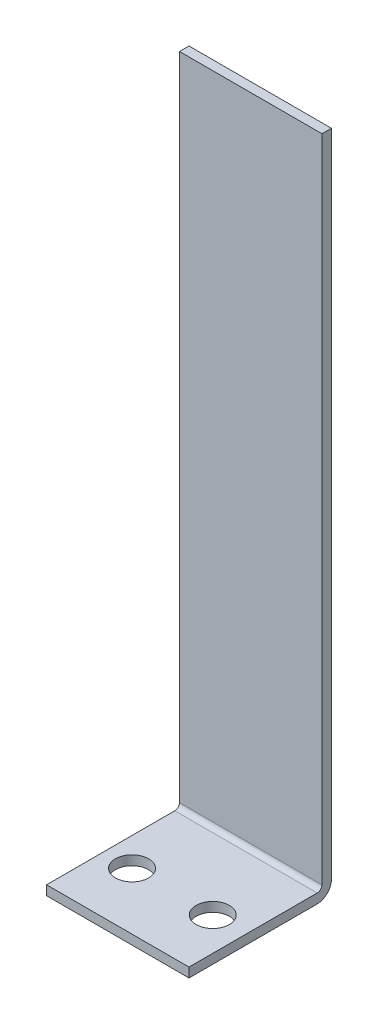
ISO-10303-21;
HEADER;
FILE_DESCRIPTION(('STEP AP214'),'2;1');
FILE_NAME('part.step','',(''),(''),'','','');
FILE_SCHEMA(('AUTOMOTIVE_DESIGN { 1 0 10303 214 1 1 1 1 }'));
ENDSEC;
DATA;
#1=APPLICATION_CONTEXT('core data for automotive mechanical design processes');
#2=APPLICATION_PROTOCOL_DEFINITION('international standard','automotive_design',2000,#1);
#3=PRODUCT_CONTEXT('',#1,'mechanical');
#4=PRODUCT('Part','Part','',(#3));
#5=PRODUCT_RELATED_PRODUCT_CATEGORY('part','',(#4));
#6=PRODUCT_DEFINITION_FORMATION('','',#4);
#7=PRODUCT_DEFINITION_CONTEXT('part definition',#1,'design');
#8=PRODUCT_DEFINITION('design','',#6,#7);
#9=PRODUCT_DEFINITION_SHAPE('','',#8);
#10=(LENGTH_UNIT() NAMED_UNIT(*) SI_UNIT(.MILLI.,.METRE.));
#11=(NAMED_UNIT(*) PLANE_ANGLE_UNIT() SI_UNIT($,.RADIAN.));
#12=(NAMED_UNIT(*) SI_UNIT($,.STERADIAN.) SOLID_ANGLE_UNIT());
#13=UNCERTAINTY_MEASURE_WITH_UNIT(LENGTH_MEASURE(1.E-05),#10,'distance_accuracy_value','');
#14=(GEOMETRIC_REPRESENTATION_CONTEXT(3) GLOBAL_UNCERTAINTY_ASSIGNED_CONTEXT((#13)) GLOBAL_UNIT_ASSIGNED_CONTEXT((#10,
#11,#12)) REPRESENTATION_CONTEXT('',''));
#15=CARTESIAN_POINT('',(0.,0.,0.));
#16=DIRECTION('',(0.,0.,1.));
#17=DIRECTION('',(1.,0.,0.));
#18=AXIS2_PLACEMENT_3D('',#15,#16,#17);
#19=CARTESIAN_POINT('',(0.,0.,30.));
#20=DIRECTION('',(0.,-1.,0.));
#21=DIRECTION('',(0.,0.,-1.));
#22=AXIS2_PLACEMENT_3D('',#19,#20,#21);
#23=PLANE('',#22);
#24=DIRECTION('',(0.,0.,1.));
#25=VECTOR('',#24,1.);
#26=CARTESIAN_POINT('',(0.,0.,30.));
#27=LINE('',#26,#25);
#28=CARTESIAN_POINT('',(0.,0.,3.));
#29=VERTEX_POINT('',#28);
#30=CARTESIAN_POINT('',(0.,0.,30.));
#31=VERTEX_POINT('',#30);
#32=EDGE_CURVE('E71',#29,#31,#27,.T.);
#33=ORIENTED_EDGE('',*,*,#32,.F.);
#34=DIRECTION('',(-1.,0.,0.));
#35=VECTOR('',#34,1.);
#36=CARTESIAN_POINT('',(0.,0.,2.99999999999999));
#37=LINE('',#36,#35);
#38=CARTESIAN_POINT('',(30.,0.,2.99999999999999));
#39=VERTEX_POINT('',#38);
#40=EDGE_CURVE('E223',#39,#29,#37,.T.);
#41=ORIENTED_EDGE('',*,*,#40,.F.);
#42=DIRECTION('',(0.,0.,1.));
#43=VECTOR('',#42,1.);
#44=CARTESIAN_POINT('',(30.,0.,30.));
#45=LINE('',#44,#43);
#46=CARTESIAN_POINT('',(30.,0.,30.));
#47=VERTEX_POINT('',#46);
#48=EDGE_CURVE('E63',#39,#47,#45,.T.);
#49=ORIENTED_EDGE('',*,*,#48,.T.);
#50=DIRECTION('',(1.,0.,0.));
#51=VECTOR('',#50,1.);
#52=CARTESIAN_POINT('',(0.,0.,30.));
#53=LINE('',#52,#51);
#54=EDGE_CURVE('E171',#47,#31,#53,.F.);
#55=ORIENTED_EDGE('',*,*,#54,.T.);
#56=EDGE_LOOP('',(#33,#41,#49,#55));
#57=FACE_BOUND('',#56,.T.);
#58=CARTESIAN_POINT('',(6.,0.,18.));
#59=DIRECTION('',(0.,1.,0.));
#60=DIRECTION('',(0.,0.,1.));
#61=AXIS2_PLACEMENT_3D('',#58,#59,#60);
#62=CIRCLE('',#61,3.5);
#63=CARTESIAN_POINT('',(6.,0.,21.5));
#64=VERTEX_POINT('',#63);
#65=EDGE_CURVE('E169',#64,#64,#62,.T.);
#66=ORIENTED_EDGE('',*,*,#65,.T.);
#67=EDGE_LOOP('',(#66));
#68=FACE_BOUND('',#67,.T.);
#69=CARTESIAN_POINT('',(23.,0.,18.));
#70=DIRECTION('',(0.,1.,0.));
#71=DIRECTION('',(0.,0.,1.));
#72=AXIS2_PLACEMENT_3D('',#69,#70,#71);
#73=CIRCLE('',#72,3.5);
#74=CARTESIAN_POINT('',(23.,0.,21.5));
#75=VERTEX_POINT('',#74);
#76=EDGE_CURVE('E20',#75,#75,#73,.T.);
#77=ORIENTED_EDGE('',*,*,#76,.T.);
#78=EDGE_LOOP('',(#77));
#79=FACE_BOUND('',#78,.T.);
#80=ADVANCED_FACE('F17',(#57,#68,#79),#23,.T.);
#81=CARTESIAN_POINT('',(23.,2.,18.));
#82=DIRECTION('',(0.,1.,0.));
#83=DIRECTION('',(0.,0.,1.));
#84=AXIS2_PLACEMENT_3D('',#81,#82,#83);
#85=CYLINDRICAL_SURFACE('',#84,3.5);
#86=ORIENTED_EDGE('',*,*,#76,.F.);
#87=EDGE_LOOP('',(#86));
#88=FACE_BOUND('',#87,.T.);
#89=CARTESIAN_POINT('',(23.,2.,18.));
#90=DIRECTION('',(0.,1.,0.));
#91=DIRECTION('',(0.,0.,1.));
#92=AXIS2_PLACEMENT_3D('',#89,#90,#91);
#93=CIRCLE('',#92,3.5);
#94=CARTESIAN_POINT('',(23.,2.,21.5));
#95=VERTEX_POINT('',#94);
#96=EDGE_CURVE('E156',#95,#95,#93,.T.);
#97=ORIENTED_EDGE('',*,*,#96,.T.);
#98=EDGE_LOOP('',(#97));
#99=FACE_BOUND('',#98,.T.);
#100=ADVANCED_FACE('F143',(#88,#99),#85,.F.);
#101=CARTESIAN_POINT('',(6.,2.,18.));
#102=DIRECTION('',(0.,1.,0.));
#103=DIRECTION('',(0.,0.,1.));
#104=AXIS2_PLACEMENT_3D('',#101,#102,#103);
#105=CYLINDRICAL_SURFACE('',#104,3.5);
#106=ORIENTED_EDGE('',*,*,#65,.F.);
#107=EDGE_LOOP('',(#106));
#108=FACE_BOUND('',#107,.T.);
#109=CARTESIAN_POINT('',(6.,2.,18.));
#110=DIRECTION('',(0.,1.,0.));
#111=DIRECTION('',(0.,0.,1.));
#112=AXIS2_PLACEMENT_3D('',#109,#110,#111);
#113=CIRCLE('',#112,3.5);
#114=CARTESIAN_POINT('',(6.,2.,21.5));
#115=VERTEX_POINT('',#114);
#116=EDGE_CURVE('E158',#115,#115,#113,.T.);
#117=ORIENTED_EDGE('',*,*,#116,.T.);
#118=EDGE_LOOP('',(#117));
#119=FACE_BOUND('',#118,.T.);
#120=ADVANCED_FACE('F140',(#108,#119),#105,.F.);
#121=CARTESIAN_POINT('',(0.,2.,30.));
#122=DIRECTION('',(0.,0.,-1.));
#123=DIRECTION('',(0.,1.,0.));
#124=AXIS2_PLACEMENT_3D('',#121,#122,#123);
#125=PLANE('',#124);
#126=ORIENTED_EDGE('',*,*,#54,.F.);
#127=DIRECTION('',(0.,1.,0.));
#128=VECTOR('',#127,1.);
#129=CARTESIAN_POINT('',(30.,2.,30.));
#130=LINE('',#129,#128);
#131=CARTESIAN_POINT('',(30.,2.,30.));
#132=VERTEX_POINT('',#131);
#133=EDGE_CURVE('E177',#47,#132,#130,.T.);
#134=ORIENTED_EDGE('',*,*,#133,.T.);
#135=DIRECTION('',(1.,0.,0.));
#136=VECTOR('',#135,1.);
#137=CARTESIAN_POINT('',(0.,2.,30.));
#138=LINE('',#137,#136);
#139=CARTESIAN_POINT('',(0.,2.,30.));
#140=VERTEX_POINT('',#139);
#141=EDGE_CURVE('E162',#132,#140,#138,.F.);
#142=ORIENTED_EDGE('',*,*,#141,.T.);
#143=DIRECTION('',(0.,1.,0.));
#144=VECTOR('',#143,1.);
#145=CARTESIAN_POINT('',(0.,2.,30.));
#146=LINE('',#145,#144);
#147=EDGE_CURVE('E168',#31,#140,#146,.T.);
#148=ORIENTED_EDGE('',*,*,#147,.F.);
#149=EDGE_LOOP('',(#126,#134,#142,#148));
#150=FACE_BOUND('',#149,.T.);
#151=ADVANCED_FACE('F136',(#150),#125,.F.);
#152=CARTESIAN_POINT('',(0.,3.,2.99999999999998));
#153=DIRECTION('',(-1.,0.,0.));
#154=DIRECTION('',(0.,0.,1.));
#155=AXIS2_PLACEMENT_3D('',#152,#153,#154);
#156=CYLINDRICAL_SURFACE('',#155,3.);
#157=CARTESIAN_POINT('',(30.,3.,2.99999999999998));
#158=DIRECTION('',(-1.,0.,0.));
#159=DIRECTION('',(0.,0.,1.));
#160=AXIS2_PLACEMENT_3D('',#157,#158,#159);
#161=CIRCLE('',#160,3.);
#162=CARTESIAN_POINT('',(30.,3.,0.));
#163=VERTEX_POINT('',#162);
#164=EDGE_CURVE('E164',#39,#163,#161,.F.);
#165=ORIENTED_EDGE('',*,*,#164,.F.);
#166=ORIENTED_EDGE('',*,*,#40,.T.);
#167=CARTESIAN_POINT('',(0.,3.,2.99999999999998));
#168=DIRECTION('',(-1.,0.,0.));
#169=DIRECTION('',(0.,0.,1.));
#170=AXIS2_PLACEMENT_3D('',#167,#168,#169);
#171=CIRCLE('',#170,3.);
#172=CARTESIAN_POINT('',(0.,3.,0.));
#173=VERTEX_POINT('',#172);
#174=EDGE_CURVE('E185',#173,#29,#171,.T.);
#175=ORIENTED_EDGE('',*,*,#174,.F.);
#176=DIRECTION('',(1.,0.,0.));
#177=VECTOR('',#176,1.);
#178=CARTESIAN_POINT('',(0.,3.,0.));
#179=LINE('',#178,#177);
#180=EDGE_CURVE('E186',#163,#173,#179,.F.);
#181=ORIENTED_EDGE('',*,*,#180,.F.);
#182=EDGE_LOOP('',(#165,#166,#175,#181));
#183=FACE_BOUND('',#182,.T.);
#184=ADVANCED_FACE('F132',(#183),#156,.T.);
#185=CARTESIAN_POINT('',(0.,2.,30.));
#186=DIRECTION('',(0.,-1.,0.));
#187=DIRECTION('',(0.,0.,-1.));
#188=AXIS2_PLACEMENT_3D('',#185,#186,#187);
#189=PLANE('',#188);
#190=DIRECTION('',(-1.,0.,0.));
#191=VECTOR('',#190,1.);
#192=CARTESIAN_POINT('',(0.,2.,2.99999999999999));
#193=LINE('',#192,#191);
#194=CARTESIAN_POINT('',(30.,2.,2.99999999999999));
#195=VERTEX_POINT('',#194);
#196=CARTESIAN_POINT('',(0.,2.,3.));
#197=VERTEX_POINT('',#196);
#198=EDGE_CURVE('E184',#195,#197,#193,.T.);
#199=ORIENTED_EDGE('',*,*,#198,.T.);
#200=DIRECTION('',(0.,0.,-1.));
#201=VECTOR('',#200,1.);
#202=CARTESIAN_POINT('',(0.,2.,30.));
#203=LINE('',#202,#201);
#204=EDGE_CURVE('E194',#140,#197,#203,.T.);
#205=ORIENTED_EDGE('',*,*,#204,.F.);
#206=ORIENTED_EDGE('',*,*,#141,.F.);
#207=DIRECTION('',(0.,0.,-1.));
#208=VECTOR('',#207,1.);
#209=CARTESIAN_POINT('',(30.,2.,30.));
#210=LINE('',#209,#208);
#211=EDGE_CURVE('E189',#195,#132,#210,.F.);
#212=ORIENTED_EDGE('',*,*,#211,.F.);
#213=EDGE_LOOP('',(#199,#205,#206,#212));
#214=FACE_BOUND('',#213,.T.);
#215=ORIENTED_EDGE('',*,*,#116,.F.);
#216=EDGE_LOOP('',(#215));
#217=FACE_BOUND('',#216,.T.);
#218=ORIENTED_EDGE('',*,*,#96,.F.);
#219=EDGE_LOOP('',(#218));
#220=FACE_BOUND('',#219,.T.);
#221=ADVANCED_FACE('F128',(#214,#217,#220),#189,.F.);
#222=CARTESIAN_POINT('',(0.,140.,0.));
#223=DIRECTION('',(0.,0.,-1.));
#224=DIRECTION('',(0.,1.,0.));
#225=AXIS2_PLACEMENT_3D('',#222,#223,#224);
#226=PLANE('',#225);
#227=DIRECTION('',(0.,1.,0.));
#228=VECTOR('',#227,1.);
#229=CARTESIAN_POINT('',(30.,140.,0.));
#230=LINE('',#229,#228);
#231=CARTESIAN_POINT('',(30.,140.,0.));
#232=VERTEX_POINT('',#231);
#233=EDGE_CURVE('E207',#232,#163,#230,.F.);
#234=ORIENTED_EDGE('',*,*,#233,.T.);
#235=ORIENTED_EDGE('',*,*,#180,.T.);
#236=DIRECTION('',(0.,1.,0.));
#237=VECTOR('',#236,1.);
#238=CARTESIAN_POINT('',(0.,140.,0.));
#239=LINE('',#238,#237);
#240=CARTESIAN_POINT('',(0.,140.,0.));
#241=VERTEX_POINT('',#240);
#242=EDGE_CURVE('E97',#241,#173,#239,.F.);
#243=ORIENTED_EDGE('',*,*,#242,.F.);
#244=DIRECTION('',(1.,0.,0.));
#245=VECTOR('',#244,1.);
#246=CARTESIAN_POINT('',(0.,140.,0.));
#247=LINE('',#246,#245);
#248=EDGE_CURVE('E102',#232,#241,#247,.F.);
#249=ORIENTED_EDGE('',*,*,#248,.F.);
#250=EDGE_LOOP('',(#234,#235,#243,#249));
#251=FACE_BOUND('',#250,.T.);
#252=ADVANCED_FACE('F125',(#251),#226,.T.);
#253=CARTESIAN_POINT('',(0.,140.,2.));
#254=DIRECTION('',(0.,1.,0.));
#255=DIRECTION('',(0.,0.,1.));
#256=AXIS2_PLACEMENT_3D('',#253,#254,#255);
#257=PLANE('',#256);
#258=DIRECTION('',(0.,0.,1.));
#259=VECTOR('',#258,1.);
#260=CARTESIAN_POINT('',(0.,140.,2.));
#261=LINE('',#260,#259);
#262=CARTESIAN_POINT('',(0.,140.,2.));
#263=VERTEX_POINT('',#262);
#264=EDGE_CURVE('E100',#263,#241,#261,.F.);
#265=ORIENTED_EDGE('',*,*,#264,.F.);
#266=DIRECTION('',(1.,0.,0.));
#267=VECTOR('',#266,1.);
#268=CARTESIAN_POINT('',(0.,140.,2.));
#269=LINE('',#268,#267);
#270=CARTESIAN_POINT('',(30.,140.,2.));
#271=VERTEX_POINT('',#270);
#272=EDGE_CURVE('E88',#263,#271,#269,.T.);
#273=ORIENTED_EDGE('',*,*,#272,.T.);
#274=DIRECTION('',(0.,0.,1.));
#275=VECTOR('',#274,1.);
#276=CARTESIAN_POINT('',(30.,140.,2.));
#277=LINE('',#276,#275);
#278=EDGE_CURVE('E187',#271,#232,#277,.F.);
#279=ORIENTED_EDGE('',*,*,#278,.T.);
#280=ORIENTED_EDGE('',*,*,#248,.T.);
#281=EDGE_LOOP('',(#265,#273,#279,#280));
#282=FACE_BOUND('',#281,.T.);
#283=ADVANCED_FACE('F101',(#282),#257,.T.);
#284=CARTESIAN_POINT('',(30.,140.,2.));
#285=DIRECTION('',(-1.,0.,0.));
#286=DIRECTION('',(0.,0.,1.));
#287=AXIS2_PLACEMENT_3D('',#284,#285,#286);
#288=PLANE('',#287);
#289=ORIENTED_EDGE('',*,*,#233,.F.);
#290=ORIENTED_EDGE('',*,*,#278,.F.);
#291=DIRECTION('',(0.,1.,0.));
#292=VECTOR('',#291,1.);
#293=CARTESIAN_POINT('',(30.,140.,2.));
#294=LINE('',#293,#292);
#295=CARTESIAN_POINT('',(30.,3.,1.99999999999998));
#296=VERTEX_POINT('',#295);
#297=EDGE_CURVE('E94',#271,#296,#294,.F.);
#298=ORIENTED_EDGE('',*,*,#297,.T.);
#299=CARTESIAN_POINT('',(30.,3.,2.99999999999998));
#300=DIRECTION('',(-1.,0.,0.));
#301=DIRECTION('',(0.,0.,1.));
#302=AXIS2_PLACEMENT_3D('',#299,#300,#301);
#303=CIRCLE('',#302,1.);
#304=EDGE_CURVE('E159',#296,#195,#303,.T.);
#305=ORIENTED_EDGE('',*,*,#304,.T.);
#306=ORIENTED_EDGE('',*,*,#211,.T.);
#307=ORIENTED_EDGE('',*,*,#133,.F.);
#308=ORIENTED_EDGE('',*,*,#48,.F.);
#309=ORIENTED_EDGE('',*,*,#164,.T.);
#310=EDGE_LOOP('',(#289,#290,#298,#305,#306,#307,#308,#309));
#311=FACE_BOUND('',#310,.T.);
#312=ADVANCED_FACE('F117',(#311),#288,.F.);
#313=CARTESIAN_POINT('',(0.,3.,2.99999999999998));
#314=DIRECTION('',(-1.,0.,0.));
#315=DIRECTION('',(0.,0.,1.));
#316=AXIS2_PLACEMENT_3D('',#313,#314,#315);
#317=CYLINDRICAL_SURFACE('',#316,1.);
#318=ORIENTED_EDGE('',*,*,#198,.F.);
#319=ORIENTED_EDGE('',*,*,#304,.F.);
#320=DIRECTION('',(1.,0.,0.));
#321=VECTOR('',#320,1.);
#322=CARTESIAN_POINT('',(0.,3.,1.99999999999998));
#323=LINE('',#322,#321);
#324=CARTESIAN_POINT('',(0.,3.,1.99999999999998));
#325=VERTEX_POINT('',#324);
#326=EDGE_CURVE('E26',#296,#325,#323,.F.);
#327=ORIENTED_EDGE('',*,*,#326,.T.);
#328=CARTESIAN_POINT('',(0.,3.,2.99999999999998));
#329=DIRECTION('',(-1.,0.,0.));
#330=DIRECTION('',(0.,0.,1.));
#331=AXIS2_PLACEMENT_3D('',#328,#329,#330);
#332=CIRCLE('',#331,1.);
#333=EDGE_CURVE('E34',#197,#325,#332,.F.);
#334=ORIENTED_EDGE('',*,*,#333,.F.);
#335=EDGE_LOOP('',(#318,#319,#327,#334));
#336=FACE_BOUND('',#335,.T.);
#337=ADVANCED_FACE('F109',(#336),#317,.F.);
#338=CARTESIAN_POINT('',(0.,140.,2.));
#339=DIRECTION('',(-1.,0.,0.));
#340=DIRECTION('',(0.,0.,1.));
#341=AXIS2_PLACEMENT_3D('',#338,#339,#340);
#342=PLANE('',#341);
#343=ORIENTED_EDGE('',*,*,#242,.T.);
#344=ORIENTED_EDGE('',*,*,#174,.T.);
#345=ORIENTED_EDGE('',*,*,#32,.T.);
#346=ORIENTED_EDGE('',*,*,#147,.T.);
#347=ORIENTED_EDGE('',*,*,#204,.T.);
#348=ORIENTED_EDGE('',*,*,#333,.T.);
#349=DIRECTION('',(0.,1.,0.));
#350=VECTOR('',#349,1.);
#351=CARTESIAN_POINT('',(0.,140.,2.));
#352=LINE('',#351,#350);
#353=EDGE_CURVE('E11',#325,#263,#352,.T.);
#354=ORIENTED_EDGE('',*,*,#353,.T.);
#355=ORIENTED_EDGE('',*,*,#264,.T.);
#356=EDGE_LOOP('',(#343,#344,#345,#346,#347,#348,#354,#355));
#357=FACE_BOUND('',#356,.T.);
#358=ADVANCED_FACE('F106',(#357),#342,.T.);
#359=CARTESIAN_POINT('',(0.,140.,2.));
#360=DIRECTION('',(0.,0.,-1.));
#361=DIRECTION('',(0.,1.,0.));
#362=AXIS2_PLACEMENT_3D('',#359,#360,#361);
#363=PLANE('',#362);
#364=ORIENTED_EDGE('',*,*,#326,.F.);
#365=ORIENTED_EDGE('',*,*,#297,.F.);
#366=ORIENTED_EDGE('',*,*,#272,.F.);
#367=ORIENTED_EDGE('',*,*,#353,.F.);
#368=EDGE_LOOP('',(#364,#365,#366,#367));
#369=FACE_BOUND('',#368,.T.);
#370=ADVANCED_FACE('F91',(#369),#363,.F.);
#371=CLOSED_SHELL('',(#80,#100,#120,#151,#184,#221,#252,#283,#312,#337,#358,#370));
#372=MANIFOLD_SOLID_BREP('B1',#371);
#373=ADVANCED_BREP_SHAPE_REPRESENTATION('',(#18,#372),#14);
#374=SHAPE_DEFINITION_REPRESENTATION(#9,#373);
ENDSEC;
END-ISO-10303-21;
